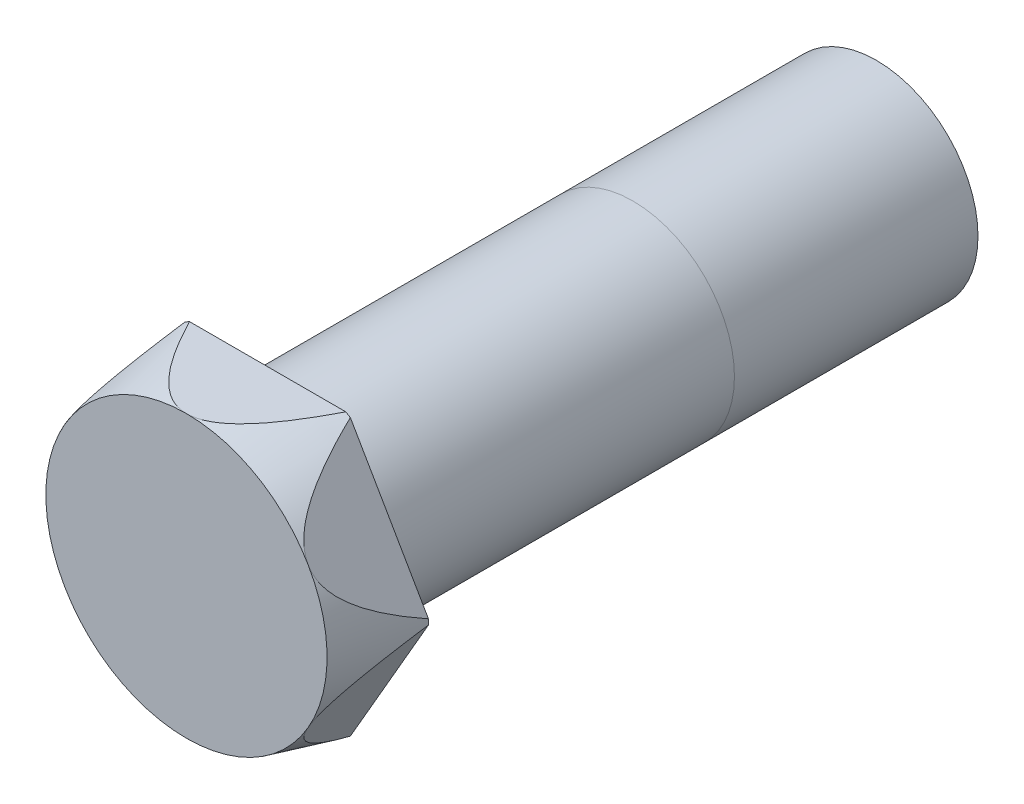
from build123d import *

# Parameters (mm, degrees)
BOSS_EXTRUDE1_DEPTH = 2.54
SKETCH2_R           = 3.175
BOSS_EXTRUDE2_DEPTH = 19.05
SKETCH3_OUTSIDE_W   = 26.746
SKETCH3_OUTSIDE_H   = 25.384
SKETCH3_OUTSIDE_R   = 4.399409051
CUT_EXTRUDE1_DEPTH  = 19.05
CUT_EXTRUDE1_DRAFT  = -14


with BuildPart() as part:
    # Sketch1 → Boss-Extrude1 (new body)
    with BuildSketch(Plane.XY):
        Polygon((-2.54, 4.399409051), (-5.08, 0), (-2.54, -4.399409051), (2.54, -4.399409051), (5.08, 0), (2.54, 4.399409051), align=None)
    extrude(amount=BOSS_EXTRUDE1_DEPTH)

    # Sketch2 → Boss-Extrude2 (add)
    with BuildSketch(Plane(origin=(0, 0, 0), x_dir=(-1, 0, 0), z_dir=(0, 0, -1))):
        with Locations(Location((0, 0, 0), (0, 0, 180))):
            Circle(SKETCH2_R)
    extrude(amount=BOSS_EXTRUDE2_DEPTH)


with BuildPart() as cut_extrude1_tool:
    # Sketch3 outside → Cut-Extrude1 (with draft: the straight prism first)
    with BuildSketch(Plane.XY.offset(2.54)):
        Rectangle(SKETCH3_OUTSIDE_W, SKETCH3_OUTSIDE_H)
        Circle(SKETCH3_OUTSIDE_R, mode=Mode.SUBTRACT)
    extrude(amount=-CUT_EXTRUDE1_DEPTH)
    # Cut-Extrude1: the draft: its side faces are tilted about the plane it starts from
    cut_extrude1_sides = [cut_extrude1_tool.faces().sort_by_distance(p)[0] for p in [
        (0, -12.692, -6.985),
        (13.373, 0, -6.985),
        (0, 12.692, -6.985),
        (-13.373, 0, -6.985),
        (-4.399409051, 0, -6.985),
    ]]
    draft(cut_extrude1_sides, Plane.XY.offset(2.54), CUT_EXTRUDE1_DRAFT)


with BuildPart() as part_1:
    add(part.part)

    # Cut-Extrude1: cut by cut_extrude1_tool
    add(cut_extrude1_tool.part, mode=Mode.SUBTRACT)


solid = part_1.part
